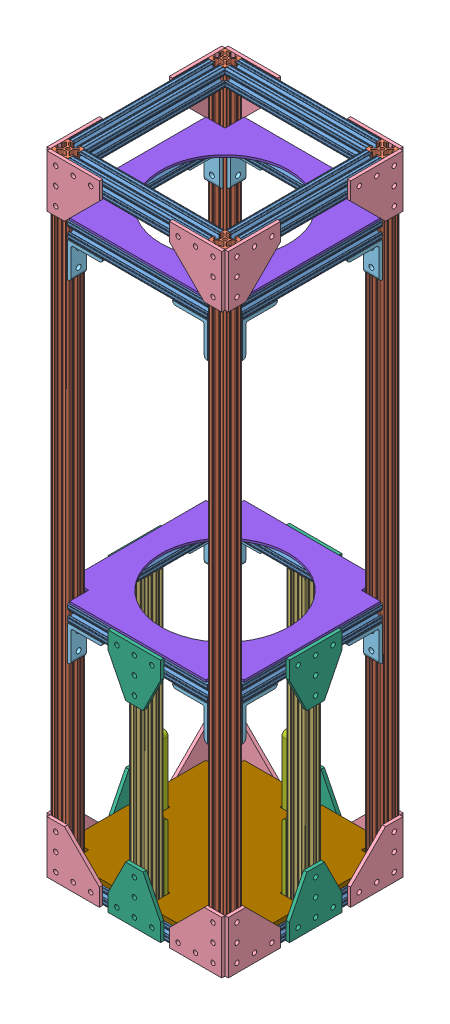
SolidWorks assembly Pressurant_Tank_Support.SLDASM, configuration Default (file format 15000). Lengths in mm.
Overall size (263.52 914.4 263.52).
71 component instances, 9 part files, 209 mates.
Components (placement in the parent):
- 8 in t slot-1: 8 in t slot.SLDPRT [47065T411] at (72.6323 102.8129 159.8639) size (25.4 25.4 203.2)
- 3 feet t-slot-1: 3 feet t-slot.SLDPRT [47065T412] at (72.6323 547.3129 274.1639) x (1 0 0) z (0 -1 0) size (25.4 25.4 914.4)
- 3 feet t-slot-2: 3 feet t-slot.SLDPRT [47065T412] at (301.2323 547.3129 274.1639) x (1 0 0) z (0 -1 0) size (25.4 25.4 914.4)
- 3 feet t-slot-3: 3 feet t-slot.SLDPRT [47065T412] at (301.2323 547.3129 45.5639) x (1 0 0) z (0 -1 0) size (25.4 25.4 914.4)
- 3 feet t-slot-4: 3 feet t-slot.SLDPRT [47065T412] at (72.6323 547.3129 45.5639) x (1 0 0) z (0 -1 0) size (25.4 25.4 914.4)
- 8 in t slot-2: 8 in t slot.SLDPRT [47065T411] at (186.9323 102.8129 274.1639) x (0 0 1) z (-1 0 0) size (25.4 25.4 203.2)
- 8 in t slot-3: 8 in t slot.SLDPRT [47065T411] at (301.2323 102.8129 159.8639) size (25.4 25.4 203.2)
- 8 in t slot-4: 8 in t slot.SLDPRT [47065T411] at (186.9323 102.8129 45.5639) x (0 0 -1) z (1 0 0) size (25.4 25.4 203.2)
- 1 foot t slot-1: 1 foot t slot.SLDPRT [47065T411] at (72.6323 267.9129 159.8639) x (0 0 1) z (0 1 0) size (25.4 25.4 304.8)
- 1 foot t slot-2: 1 foot t slot.SLDPRT [47065T411] at (186.9323 267.9129 45.5639) x (0 0 1) z (0 1 0) size (25.4 25.4 304.8)
- 1 foot t slot-3: 1 foot t slot.SLDPRT [47065T411] at (301.2323 267.9129 159.8639) x (0 0 1) z (0 1 0) size (25.4 25.4 304.8)
- 1 foot t slot-4: 1 foot t slot.SLDPRT [47065T411] at (186.9323 267.9129 274.1639) x (0 0 1) z (0 1 0) size (25.4 25.4 304.8)
- 8 in t slot-5: 8 in t slot.SLDPRT [47065T411] at (186.9323 433.0129 45.5639) x (0 0 1) z (-1 0 0) size (25.4 25.4 203.2)
- 8 in t slot-6: 8 in t slot.SLDPRT [47065T411] at (301.2323 433.0129 159.8639) size (25.4 25.4 203.2)
- 8 in t slot-7: 8 in t slot.SLDPRT [47065T411] at (186.9323 433.0129 274.1639) x (0 0 1) z (-1 0 0) size (25.4 25.4 203.2)
- 8 in t slot-8: 8 in t slot.SLDPRT [47065T411] at (72.6323 433.0129 159.8639) size (25.4 25.4 203.2)
- 8 in t slot-9: 8 in t slot.SLDPRT [47065T411] at (301.2323 991.8129 159.8639) size (25.4 25.4 203.2)
- 8 in t slot-10: 8 in t slot.SLDPRT [47065T411] at (186.9323 991.8129 274.1639) x (0 0 1) z (-1 0 0) size (25.4 25.4 203.2)
- 8 in t slot-11: 8 in t slot.SLDPRT [47065T411] at (186.9323 991.8129 45.5639) x (0 -1 0) z (1 0 0) size (25.4 25.4 203.2)
- 8 in t slot-12: 8 in t slot.SLDPRT [47065T411] at (72.6323 991.8129 159.8639) size (25.4 25.4 203.2)
- corner brace-1: corner brace.SLDPRT [47065T267] at (57.551 1004.5129 286.8639) x (0 0 -1) z (-1 0 0) size (76.2 76.2 4.76)
- corner brace-2: corner brace.SLDPRT [47065T267] at (59.9323 90.1129 289.2452) size (76.2 76.2 4.76)
- corner brace-3: corner brace.SLDPRT [47065T267] at (313.9323 90.1129 289.2452) x (-1 0 0) z (0 0 -1) size (76.2 76.2 4.76)
- corner brace-4: corner brace.SLDPRT [47065T267] at (316.3135 90.1129 286.8639) x (0 0 -1) z (1 0 0) size (76.2 76.2 4.76)
- corner brace-5: corner brace.SLDPRT [47065T267] at (316.3135 90.1129 32.8639) x (0 0 1) z (-1 0 0) size (76.2 76.2 4.76)
- corner brace-6: corner brace.SLDPRT [47065T267] at (59.9323 90.1129 30.4827) size (76.2 76.2 4.76)
- corner brace-7: corner brace.SLDPRT [47065T267] at (313.9323 90.1129 30.4827) x (-1 0 0) z (0 0 -1) size (76.2 76.2 4.76)
- corner brace-8: corner brace.SLDPRT [47065T267] at (57.551 90.1129 32.8639) x (0 0 1) z (-1 0 0) size (76.2 76.2 4.76)
- corner brace-10: corner brace.SLDPRT [47065T267] at (316.3135 1004.5129 32.8639) x (0 -1 0) z (-1 0 0) size (76.2 76.2 4.76)
- corner brace-11: corner brace.SLDPRT [47065T267] at (313.9323 1004.5129 30.4827) x (-1 0 0) z (0 0 1) size (76.2 76.2 4.76)
- corner brace-12: corner brace.SLDPRT [47065T267] at (316.3135 1004.5129 286.8639) x (0 -1 0) z (1 0 0) size (76.2 76.2 4.76)
- corner brace-13: corner brace.SLDPRT [47065T267] at (313.9323 1004.5129 289.2452) x (-1 0 0) z (0 0 1) size (76.2 76.2 4.76)
- corner brace-14: corner brace.SLDPRT [47065T267] at (59.9323 1004.5129 289.2452) x (1 0 0) z (0 0 -1) size (76.2 76.2 4.76)
- corner brace-15: corner brace.SLDPRT [47065T267] at (57.551 90.1129 286.8639) x (0 0 -1) z (1 0 0) size (76.2 76.2 4.76)
- corner brace_2-1: corner brace_2.SLDPRT [47065T239] at (71.0448 420.3129 261.4639) x (0 -1 0) z (1 0 0) size (50.8 50.8 22.23)
- corner brace_2-2: corner brace_2.SLDPRT [47065T239] at (71.0448 420.3129 58.2639) x (0 -1 0) z (-1 0 0) size (50.8 50.8 22.23)
- corner brace_2-3: corner brace_2.SLDPRT [47065T239] at (85.3323 420.3129 43.9764) x (0 -1 0) z (0 0 1) size (50.8 50.8 22.23)
- corner brace_2-4: corner brace_2.SLDPRT [47065T239] at (288.5323 420.3129 43.9764) x (0 -1 0) z (0 0 -1) size (50.8 50.8 22.23)
- corner brace_2-5: corner brace_2.SLDPRT [47065T239] at (85.3323 420.3129 275.7514) x (0 -1 0) z (0 0 1) size (50.8 50.8 22.23)
- corner brace_2-6: corner brace_2.SLDPRT [47065T239] at (288.5323 420.3129 275.7514) x (0 -1 0) z (0 0 -1) size (50.8 50.8 22.23)
- corner brace_2-7: corner brace_2.SLDPRT [47065T239] at (302.8198 420.3129 261.4639) x (0 -1 0) z (1 0 0) size (50.8 50.8 22.23)
- corner brace_2-8: corner brace_2.SLDPRT [47065T239] at (302.8198 420.3129 58.2639) x (0 -1 0) z (-1 0 0) size (50.8 50.8 22.23)
- t bracket-1: t bracket.SLDPRT [47065T278] at (148.8323 90.1129 30.4827) size (76.2 76.2 4.76)
- t bracket-2: t bracket.SLDPRT [47065T278] at (57.551 90.1129 121.7639) x (0 0 1) z (-1 0 0) size (76.2 76.2 4.76)
- t bracket-3: t bracket.SLDPRT [47065T278] at (148.8323 90.1129 289.2452) size (76.2 76.2 4.76)
- t bracket-4: t bracket.SLDPRT [47065T278] at (316.3135 90.1129 197.9639) x (0 0 -1) z (1 0 0) size (76.2 76.2 4.76)
- 47065T841_ALUMINUM T-SLOTTED FRAMING EXTRUSION-1: 47065T841_ALUMINUM T-SLOTTED FRAMING EXTRUSION.SLDPRT [47065T841] at (85.3323 90.1129 159.8639) size (50.8 127 25.4)
- 47065T841_ALUMINUM T-SLOTTED FRAMING EXTRUSION-2: 47065T841_ALUMINUM T-SLOTTED FRAMING EXTRUSION.SLDPRT [47065T841] at (186.9323 90.1129 58.2639) x (0 0 1) z (-1 0 0) size (50.8 127 25.4)
- 47065T841_ALUMINUM T-SLOTTED FRAMING EXTRUSION-3: 47065T841_ALUMINUM T-SLOTTED FRAMING EXTRUSION.SLDPRT [47065T841] at (288.5323 90.1129 159.8639) x (-1 0 0) z (0 0 -1) size (50.8 127 25.4)
- 47065T841_ALUMINUM T-SLOTTED FRAMING EXTRUSION-4: 47065T841_ALUMINUM T-SLOTTED FRAMING EXTRUSION.SLDPRT [47065T841] at (186.9323 90.1129 261.4639) x (0 0 -1) z (1 0 0) size (50.8 127 25.4)
- Pressurant Tank mid-holder-1: Pressurant Tank mid-holder.SLDPRT [Default] at (186.9323 445.7129 159.8639) size (254 3.17 254)
- 8 in t slot-13: 8 in t slot.SLDPRT [47065T411] at (186.9323 915.6129 274.1639) x (0 0 -1) z (1 0 0) size (25.4 25.4 203.2)
- 8 in t slot-14: 8 in t slot.SLDPRT [47065T411] at (186.9323 915.6129 45.5639) x (0 0 -1) z (1 0 0) size (25.4 25.4 203.2)
- 8 in t slot-15: 8 in t slot.SLDPRT [47065T411] at (301.2323 915.6129 159.8639) size (25.4 25.4 203.2)
- 8 in t slot-16: 8 in t slot.SLDPRT [47065T411] at (72.6323 915.6129 159.8639) size (25.4 25.4 203.2)
- Pressurant Tank mid-holder-2: Pressurant Tank mid-holder.SLDPRT [Default] at (186.9323 928.3129 159.8639) size (254 3.17 254)
- corner brace-16: corner brace.SLDPRT [47065T267] at (57.551 1004.5129 32.8639) x (0 -1 0) z (-1 0 0) size (76.2 76.2 4.76)
- corner brace-17: corner brace.SLDPRT [47065T267] at (59.9323 1004.5129 30.4827) x (1 0 0) z (0 0 -1) size (76.2 76.2 4.76)
- Pressurant Tank bottom-holder plate-1: Pressurant Tank bottom-holder plate.SLDPRT [Default] at (186.9323 115.5129 159.8639) size (254 6.35 254)
- t bracket-5: t bracket.SLDPRT [47065T278] at (148.8323 445.7129 289.2452) x (1 0 0) z (0 0 -1) size (76.2 76.2 4.76)
- t bracket-6: t bracket.SLDPRT [47065T278] at (225.0323 448.2991 30.4827) x (-1 0 0) z (0 0 1) size (76.2 76.2 4.76)
- t bracket-7: t bracket.SLDPRT [47065T278] at (316.3135 445.7129 121.7639) x (0 0 1) z (1 0 0) size (76.2 76.2 4.76)
- t bracket-8: t bracket.SLDPRT [47065T278] at (57.551 445.7129 197.9639) x (0 0 -1) z (-1 0 0) size (76.2 76.2 4.76)
- corner brace_2-9: corner brace_2.SLDPRT [47065T239] at (288.5323 902.9129 275.7514) x (0 -1 0) z (0 0 -1) size (50.8 50.8 22.23)
- corner brace_2-10: corner brace_2.SLDPRT [47065T239] at (85.3323 902.9129 275.7514) x (0 -1 0) z (0 0 1) size (50.8 50.8 22.23)
- corner brace_2-11: corner brace_2.SLDPRT [47065T239] at (302.8198 902.9129 261.4639) x (0 -1 0) z (1 0 0) size (50.8 50.8 22.23)
- corner brace_2-12: corner brace_2.SLDPRT [47065T239] at (71.0448 902.9129 261.4639) x (0 -1 0) z (1 0 0) size (50.8 50.8 22.23)
- corner brace_2-13: corner brace_2.SLDPRT [47065T239] at (71.0448 902.9129 58.2639) x (0 -1 0) z (-1 0 0) size (50.8 50.8 22.23)
- corner brace_2-14: corner brace_2.SLDPRT [47065T239] at (302.8198 902.9129 58.2639) x (0 -1 0) z (-1 0 0) size (50.8 50.8 22.23)
- corner brace_2-15: corner brace_2.SLDPRT [47065T239] at (85.3323 902.9129 43.9764) x (0 -1 0) z (0 0 1) size (50.8 50.8 22.23)
- corner brace_2-16: corner brace_2.SLDPRT [47065T239] at (288.5323 902.9129 43.9764) x (0 -1 0) z (0 0 -1) size (50.8 50.8 22.23)
Mates (geometry in assembly coordinates):
- Coincident1: coincident anti-aligned: plane of 8 in t slot-1 through (66.2159 93.403 261.4639) normal (0 0 1); plane of 3 feet t-slot-1 through (78.9654 90.1129 261.4639) normal (0 0 -1)
- Coincident2: coincident aligned: plane of 8 in t slot-1 through (85.3323 93.2625 261.4639) normal (1 0 0); plane of 3 feet t-slot-1 through (85.3323 90.1129 264.6135) normal (1 0 0)
- Coincident3: coincident aligned: plane of 8 in t slot-1 through (78.9654 90.1129 261.4639) normal (0 -1 0); plane of 3 feet t-slot-1 through (66.2159 90.1129 264.7541) normal (0 -1 0)
- Coincident4: coincident aligned: plane of 3 feet t-slot-1 through (82.1827 90.1129 286.8639) normal (0 0 1); plane of 8 in t slot-2 through (85.3323 109.1459 286.8639) normal (0 0 1)
- Coincident5: coincident anti-aligned: plane of 3 feet t-slot-1 through (85.3323 90.1129 280.497) normal (1 0 0); plane of 8 in t slot-2 through (85.3323 93.403 267.7475) normal (-1 0 0)
- Coincident6: coincident aligned: plane of 3 feet t-slot-1 through (66.2159 90.1129 264.7541) normal (0 -1 0); plane of 8 in t slot-2 through (85.3323 90.1129 280.4971) normal (0 -1 0)
- Coincident7: coincident aligned: plane of 3 feet t-slot-2 through (294.8159 90.1129 264.7541) normal (0 -1 0); plane of 8 in t slot-2 through (85.3323 90.1129 280.4971) normal (0 -1 0)
- Coincident8: coincident aligned: plane of 3 feet t-slot-2 through (310.7827 90.1129 286.8639) normal (0 0 1); plane of 8 in t slot-2 through (85.3323 93.2625 286.8639) normal (0 0 1)
- Coincident9: coincident anti-aligned: plane of 3 feet t-slot-2 through (288.5323 90.1129 283.7143) normal (-1 0 0); plane of 8 in t slot-2 through (288.5323 93.403 267.7475) normal (1 0 0)
- Coincident10: coincident aligned: plane of 8 in t slot-1 through (78.9654 90.1129 261.4639) normal (0 -1 0); plane of 3 feet t-slot-4 through (66.2159 90.1129 36.1541) normal (0 -1 0)
- Coincident11: coincident aligned: plane of 8 in t slot-1 through (85.3323 109.1459 261.4639) normal (1 0 0); plane of 3 feet t-slot-4 through (85.3323 90.1129 51.897) normal (1 0 0)
- Coincident12: coincident anti-aligned: plane of 8 in t slot-1 through (66.2159 93.403 58.2639) normal (0 0 -1); plane of 3 feet t-slot-4 through (82.1827 90.1129 58.2639) normal (0 0 1)
- Coincident13: coincident anti-aligned: plane of 3 feet t-slot-4 through (85.3323 90.1129 36.0135) normal (1 0 0); plane of 8 in t slot-4 through (85.3323 93.403 51.9803) normal (-1 0 0)
- Coincident14: coincident aligned: plane of 3 feet t-slot-4 through (78.9654 90.1129 32.8639) normal (0 0 -1); plane of 8 in t slot-4 through (288.5323 93.2625 32.8639) normal (0 0 -1)
- Coincident15: coincident aligned: plane of 3 feet t-slot-4 through (66.2159 90.1129 36.1541) normal (0 -1 0); plane of 8 in t slot-4 through (288.5323 90.1129 39.2308) normal (0 -1 0)
- Coincident16: coincident aligned: plane of 3 feet t-slot-3 through (294.8159 90.1129 36.1541) normal (0 -1 0); plane of 8 in t slot-4 through (288.5323 90.1129 39.2308) normal (0 -1 0)
- Coincident17: coincident aligned: plane of 3 feet t-slot-3 through (291.6819 90.1129 32.8639) normal (0 0 -1); plane of 8 in t slot-4 through (288.5323 109.1459 32.8639) normal (0 0 -1)
- Coincident18: coincident anti-aligned: plane of 3 feet t-slot-3 through (288.5323 90.1129 39.2308) normal (-1 0 0); plane of 8 in t slot-4 through (288.5323 93.403 51.9803) normal (1 0 0)
- Coincident19: coincident aligned: plane of 3 feet t-slot-2 through (288.5323 90.1129 267.8308) normal (-1 0 0); plane of 8 in t slot-3 through (288.5323 112.3633 261.4639) normal (-1 0 0)
- Coincident20: coincident aligned: plane of 3 feet t-slot-2 through (294.8159 90.1129 264.7541) normal (0 -1 0); plane of 8 in t slot-3 through (291.6819 90.1129 261.4639) normal (0 -1 0)
- Coincident21: coincident anti-aligned: plane of 3 feet t-slot-2 through (307.5654 90.1129 261.4639) normal (0 0 -1); plane of 8 in t slot-3 through (294.8159 93.403 261.4639) normal (0 0 1)
- Coincident22: coincident anti-aligned: plane of 8 in t slot-1 through (82.1827 115.5129 261.4639) normal (0 1 0); plane of 1 foot t slot-1 through (63.2225 115.5129 153.4475) normal (0 -1 0)
- Coincident23: coincident aligned: plane of 8 in t slot-1 through (85.3323 109.1459 261.4639) normal (1 0 0); plane of 1 foot t slot-1 through (85.3323 420.3129 153.5308) normal (1 0 0)
- Distance1: distance = 88.9 mm anti-aligned: plane of 3 feet t-slot-4 through (66.2992 90.1129 58.2639) normal (0 0 1); plane of 1 foot t slot-1 through (66.2992 420.3129 147.1639) normal (0 0 -1)
- Coincident25: coincident anti-aligned: plane of 8 in t slot-2 through (85.3323 115.5129 283.7144) normal (0 1 0); plane of 1 foot t slot-4 through (177.5225 115.5129 267.7475) normal (0 -1 0)
- Coincident26: coincident aligned: plane of 8 in t slot-2 through (85.3323 109.1459 286.8639) normal (0 0 1); plane of 1 foot t slot-4 through (177.3819 420.3129 286.8639) normal (0 0 1)
- Distance2: distance = 88.9 mm anti-aligned: plane of 1 foot t slot-4 through (174.2323 420.3129 280.4971) normal (-1 0 0); plane of 3 feet t-slot-1 through (85.3323 90.1129 280.497) normal (1 0 0)
- Coincident28: coincident anti-aligned: plane of 8 in t slot-3 through (310.7827 115.5129 261.4639) normal (0 1 0); plane of 1 foot t slot-3 through (291.8225 115.5129 153.4475) normal (0 -1 0)
- Coincident29: coincident aligned: plane of 8 in t slot-3 through (313.9323 109.1459 261.4639) normal (1 0 0); plane of 1 foot t slot-3 through (313.9323 420.3129 153.5308) normal (1 0 0)
- Distance3: distance = 88.9 mm anti-aligned: plane of 3 feet t-slot-2 through (307.5654 90.1129 261.4639) normal (0 0 -1); plane of 1 foot t slot-3 through (307.5654 420.3129 172.5639) normal (0 0 1)
- Coincident31: coincident anti-aligned: plane of 8 in t slot-4 through (288.5323 115.5129 36.0135) normal (0 1 0); plane of 1 foot t slot-2 through (177.5225 115.5129 39.1475) normal (0 -1 0)
- Coincident32: coincident aligned: plane of 8 in t slot-4 through (288.5323 109.1459 32.8639) normal (0 0 -1); plane of 1 foot t slot-2 through (196.4827 420.3129 32.8639) normal (0 0 -1)
- Distance4: distance = 88.9 mm anti-aligned: plane of 1 foot t slot-2 through (199.6323 420.3129 39.2308) normal (1 0 0); plane of 3 feet t-slot-3 through (288.5323 90.1129 39.2308) normal (-1 0 0)
- Coincident34: coincident aligned: plane of 1 foot t slot-2 through (196.4827 420.3129 32.8639) normal (0 0 -1); plane of 8 in t slot-5 through (85.3323 426.6798 32.8639) normal (0 0 -1)
- Coincident35: coincident anti-aligned: plane of 1 foot t slot-2 through (177.5225 420.3129 39.1475) normal (0 1 0); plane of 8 in t slot-5 through (85.3323 420.3129 36.0135) normal (0 -1 0)
- Coincident36: coincident anti-aligned: plane of 3 feet t-slot-3 through (288.5323 90.1129 39.2308) normal (-1 0 0); plane of 8 in t slot-5 through (288.5323 423.603 39.1475) normal (1 0 0)
- Coincident37: coincident anti-aligned: plane of 1 foot t slot-1 through (63.2225 420.3129 153.4475) normal (0 1 0); plane of 8 in t slot-8 through (63.0819 420.3129 261.4639) normal (0 -1 0)
- Coincident38: coincident aligned: plane of 1 foot t slot-1 through (59.9323 420.3129 150.3135) normal (-1 0 0); plane of 8 in t slot-8 through (59.9323 442.5633 261.4639) normal (-1 0 0)
- Coincident39: coincident anti-aligned: plane of 3 feet t-slot-1 through (63.0819 90.1129 261.4639) normal (0 0 -1); plane of 8 in t slot-8 through (66.2159 423.603 261.4639) normal (0 0 1)
- Coincident40: coincident aligned: plane of 1 foot t slot-3 through (313.9323 420.3129 169.4144) normal (1 0 0); plane of 8 in t slot-6 through (313.9323 439.3459 261.4639) normal (1 0 0)
- Coincident41: coincident anti-aligned: plane of 1 foot t slot-3 through (291.8225 420.3129 153.4475) normal (0 1 0); plane of 8 in t slot-6 through (307.5654 420.3129 261.4639) normal (0 -1 0)
- Coincident42: coincident anti-aligned: plane of 3 feet t-slot-2 through (307.5654 90.1129 261.4639) normal (0 0 -1); plane of 8 in t slot-6 through (294.8159 423.603 261.4639) normal (0 0 1)
- Coincident43: coincident anti-aligned: plane of 3 feet t-slot-2 through (288.5323 90.1129 283.7143) normal (-1 0 0); plane of 8 in t slot-7 through (288.5323 423.603 267.7475) normal (1 0 0)
- Coincident44: coincident aligned: plane of 1 foot t slot-4 through (193.2654 420.3129 286.8639) normal (0 0 1); plane of 8 in t slot-7 through (85.3323 423.4625 286.8639) normal (0 0 1)
- Coincident45: coincident anti-aligned: plane of 1 foot t slot-4 through (177.5225 420.3129 267.7475) normal (0 1 0); plane of 8 in t slot-7 through (85.3323 420.3129 280.4971) normal (0 -1 0)
- Coincident46: coincident aligned: plane of 3 feet t-slot-1 through (59.9323 90.1129 267.8308) normal (-1 0 0); plane of 8 in t slot-12 through (59.9323 1001.3633 261.4639) normal (-1 0 0)
- Coincident47: coincident anti-aligned: plane of 3 feet t-slot-4 through (66.2992 90.1129 58.2639) normal (0 0 1); plane of 8 in t slot-12 through (66.2159 982.403 58.2639) normal (0 0 -1)
- Coincident48: coincident aligned: plane of 3 feet t-slot-4 through (66.2159 1004.5129 36.1541) normal (0 1 0); plane of 8 in t slot-12 through (66.2992 1004.5129 261.4639) normal (0 1 0)
- Coincident49: coincident aligned: plane of 3 feet t-slot-1 through (82.1827 90.1129 286.8639) normal (0 0 1); plane of 8 in t slot-10 through (85.3323 998.1459 286.8639) normal (0 0 1)
- Coincident50: coincident anti-aligned: plane of 3 feet t-slot-1 through (85.3323 90.1129 280.497) normal (1 0 0); plane of 8 in t slot-10 through (85.3323 982.403 267.7475) normal (-1 0 0)
- Coincident51: coincident: point of 3 feet t-slot-1; plane of 8 in t slot-10 through (85.3323 1004.5129 283.7144) normal (0 1 0)
- Coincident52: coincident aligned: plane of 3 feet t-slot-2 through (294.8159 1004.5129 264.7541) normal (0 1 0); plane of 8 in t slot-9 through (294.8992 1004.5129 261.4639) normal (0 1 0)
- Coincident53: coincident anti-aligned: plane of 3 feet t-slot-2 through (291.6819 90.1129 261.4639) normal (0 0 -1); plane of 8 in t slot-9 through (294.8159 982.403 261.4639) normal (0 0 1)
- Coincident54: coincident aligned: plane of 3 feet t-slot-2 through (313.9323 90.1129 264.6135) normal (1 0 0); plane of 8 in t slot-9 through (313.9323 998.1459 261.4639) normal (1 0 0)
- Coincident55: coincident aligned: plane of 3 feet t-slot-4 through (66.2159 1004.5129 36.1541) normal (0 1 0); plane of 8 in t slot-11 through (288.5323 1004.5129 51.897) normal (0 1 0)
- Coincident56: coincident anti-aligned: plane of 3 feet t-slot-3 through (288.5323 90.1129 39.2308) normal (-1 0 0); plane of 8 in t slot-11 through (288.5323 998.2293 54.9738) normal (1 0 0)
- Coincident57: coincident aligned: plane of 3 feet t-slot-3 through (291.6819 90.1129 32.8639) normal (0 0 -1); plane of 8 in t slot-11 through (288.5323 998.146 32.8639) normal (0 0 -1)
- Coincident58: coincident aligned: plane of 3 feet t-slot-3 through (307.5654 90.1129 32.8639) normal (0 0 -1); plane of corner brace-5 through (313.9323 90.1129 32.8639) normal (0 0 -1)
- Coincident59: coincident aligned: plane of 3 feet t-slot-3 through (294.8159 90.1129 36.1541) normal (0 -1 0); plane of corner brace-5 through (313.9323 90.1129 109.0639) normal (0 -1 0)
- Coincident60: coincident anti-aligned: plane of 3 feet t-slot-3 through (313.9323 90.1129 36.0135) normal (1 0 0); plane of corner brace-5 through (313.9323 90.1129 32.8639) normal (-1 0 0)
- Coincident61: coincident aligned: plane of 3 feet t-slot-3 through (313.9323 90.1129 36.0135) normal (1 0 0); plane of corner brace-7 through (313.9323 90.1129 28.1014) normal (1 0 0)
- Coincident62: coincident aligned: plane of 8 in t slot-4 through (288.5323 90.1129 39.2308) normal (0 -1 0); plane of corner brace-7 through (237.7323 90.1129 28.1014) normal (0 -1 0)
- Coincident63: coincident anti-aligned: plane of 3 feet t-slot-3 through (291.6819 90.1129 32.8639) normal (0 0 -1); plane of corner brace-7 through (313.9323 90.1129 32.8639) normal (0 0 1)
- Coincident64: coincident aligned: plane of 3 feet t-slot-2 through (310.7827 90.1129 286.8639) normal (0 0 1); plane of corner brace-4 through (318.6948 90.1129 286.8639) normal (0 0 1)
- Coincident65: coincident aligned: plane of 8 in t slot-3 through (307.5654 90.1129 261.4639) normal (0 -1 0); plane of corner brace-4 through (318.6948 90.1129 210.6639) normal (0 -1 0)
- Coincident66: coincident anti-aligned: plane of 8 in t slot-3 through (313.9323 93.2625 261.4639) normal (1 0 0); plane of corner brace-4 through (313.9323 90.1129 286.8639) normal (-1 0 0)
- Coincident67: coincident aligned: plane of 3 feet t-slot-2 through (313.9323 90.1129 280.497) normal (1 0 0); plane of corner brace-3 through (313.9323 90.1129 286.8639) normal (1 0 0)
- Coincident68: coincident aligned: plane of 3 feet t-slot-2 through (294.8159 90.1129 264.7541) normal (0 -1 0); plane of corner brace-3 through (237.7323 90.1129 286.8639) normal (0 -1 0)
- Coincident69: coincident: line of 3 feet t-slot-2 through (310.7827 90.1129 286.8639) axis (0 1 0); plane of corner brace-3 through (313.9323 90.1129 286.8639) normal (0 0 -1)
- Coincident70: coincident aligned: plane of 3 feet t-slot-1 through (59.9323 90.1129 283.7143) normal (-1 0 0); plane of corner brace-2 through (59.9323 90.1129 291.6264) normal (-1 0 0)
- Coincident71: coincident aligned: plane of 3 feet t-slot-1 through (66.2159 90.1129 264.7541) normal (0 -1 0); plane of corner brace-2 through (136.1323 90.1129 291.6264) normal (0 -1 0)
- Coincident72: coincident anti-aligned: plane of 3 feet t-slot-1 through (66.2992 90.1129 286.8639) normal (0 0 1); plane of corner brace-2 through (59.9323 90.1129 286.8639) normal (0 0 -1)
- Coincident73: coincident aligned: plane of 3 feet t-slot-4 through (63.0819 90.1129 32.8639) normal (0 0 -1); plane of corner brace-8 through (55.1698 90.1129 32.8639) normal (0 0 -1)
- Coincident74: coincident aligned: plane of 3 feet t-slot-4 through (66.2159 90.1129 36.1541) normal (0 -1 0); plane of corner brace-8 through (55.1698 90.1129 109.0639) normal (0 -1 0)
- Coincident75: coincident anti-aligned: plane of 3 feet t-slot-4 through (59.9323 90.1129 39.2308) normal (-1 0 0); plane of corner brace-8 through (59.9323 90.1129 32.8639) normal (1 0 0)
- Coincident76: coincident aligned: plane of 3 feet t-slot-4 through (59.9323 90.1129 39.2308) normal (-1 0 0); plane of corner brace-6 through (59.9323 90.1129 32.8639) normal (-1 0 0)
- Coincident77: coincident aligned: plane of 8 in t slot-4 through (288.5323 90.1129 39.2308) normal (0 -1 0); plane of corner brace-6 through (136.1323 90.1129 32.8639) normal (0 -1 0)
- Coincident78: coincident anti-aligned: plane of 3 feet t-slot-4 through (63.0819 90.1129 32.8639) normal (0 0 -1); plane of corner brace-6 through (59.9323 90.1129 32.8639) normal (0 0 1)
- Coincident79: coincident aligned: plane of 3 feet t-slot-3 through (313.9323 90.1129 36.0135) normal (1 0 0); plane of corner brace-11 through (313.9323 1004.5129 32.8639) normal (1 0 0)
- Coincident80: coincident aligned: plane of 8 in t slot-11 through (288.5323 1004.5129 36.0135) normal (0 1 0); plane of corner brace-11 through (237.7323 1004.5129 32.8639) normal (0 1 0)
- Coincident81: coincident anti-aligned: plane of 8 in t slot-11 through (288.5323 998.146 32.8639) normal (0 0 -1); plane of corner brace-11 through (313.9323 1004.5129 32.8639) normal (0 0 1)
- Coincident82: coincident aligned: plane of 3 feet t-slot-3 through (307.5654 90.1129 32.8639) normal (0 0 -1); plane of corner brace-10 through (313.9323 928.3129 32.8639) normal (0 0 -1)
- Coincident83: coincident aligned: plane of 3 feet t-slot-3 through (294.8159 1004.5129 36.1541) normal (0 1 0); plane of corner brace-10 through (313.9323 1004.5129 32.8639) normal (0 1 0)
- Coincident84: coincident anti-aligned: plane of 3 feet t-slot-3 through (313.9323 90.1129 36.0135) normal (1 0 0); plane of corner brace-10 through (313.9323 1004.5129 32.8639) normal (-1 0 0)
- Coincident85: coincident aligned: plane of 3 feet t-slot-1 through (66.2159 1004.5129 264.7541) normal (0 1 0); plane of corner brace-1 through (55.1698 1004.5129 210.6639) normal (0 1 0)
- Coincident86: coincident aligned: plane of 3 feet t-slot-1 through (66.2992 90.1129 286.8639) normal (0 0 1); plane of corner brace-1 through (55.1698 1004.5129 286.8639) normal (0 0 1)
- Coincident87: coincident anti-aligned: plane of 8 in t slot-12 through (59.9323 1001.3633 261.4639) normal (-1 0 0); plane of corner brace-1 through (59.9323 1004.5129 286.8639) normal (1 0 0)
- Coincident88: coincident aligned: plane of 3 feet t-slot-2 through (313.9323 90.1129 280.497) normal (1 0 0); plane of corner brace-13 through (313.9323 1004.5129 291.6264) normal (1 0 0)
- Coincident89: coincident aligned: plane of 3 feet t-slot-2 through (294.8159 1004.5129 264.7541) normal (0 1 0); plane of corner brace-13 through (237.7323 1004.5129 291.6264) normal (0 1 0)
- Coincident91: coincident anti-aligned: plane of 3 feet t-slot-2 through (310.7827 90.1129 286.8639) normal (0 0 1); plane of corner brace-13 through (313.9323 1004.5129 286.8639) normal (0 0 -1)
- Coincident92: coincident aligned: plane of 3 feet t-slot-2 through (310.7827 90.1129 286.8639) normal (0 0 1); plane of corner brace-12 through (318.6948 928.3129 286.8639) normal (0 0 1)
- Coincident93: coincident aligned: plane of 8 in t slot-9 through (310.7827 1004.5129 261.4639) normal (0 1 0); plane of corner brace-12 through (318.6948 1004.5129 286.8639) normal (0 1 0)
- Coincident94: coincident anti-aligned: plane of 8 in t slot-9 through (313.9323 998.1459 261.4639) normal (1 0 0); plane of corner brace-12 through (313.9323 1004.5129 286.8639) normal (-1 0 0)
- Coincident95: coincident aligned: plane of 3 feet t-slot-1 through (59.9323 90.1129 283.7143) normal (-1 0 0); plane of corner brace-14 through (59.9323 1004.5129 286.8639) normal (-1 0 0)
- Coincident96: coincident aligned: plane of 8 in t slot-10 through (85.3323 1004.5129 283.7144) normal (0 1 0); plane of corner brace-14 through (136.1323 1004.5129 286.8639) normal (0 1 0)
- Coincident97: coincident anti-aligned: plane of 3 feet t-slot-1 through (82.1827 90.1129 286.8639) normal (0 0 1); plane of corner brace-14 through (59.9323 1004.5129 286.8639) normal (0 0 -1)
- Coincident98: coincident aligned: plane of 3 feet t-slot-1 through (66.2992 90.1129 286.8639) normal (0 0 1); plane of corner brace-15 through (59.9323 90.1129 286.8639) normal (0 0 1)
- Coincident99: coincident aligned: plane of 3 feet t-slot-1 through (66.2159 90.1129 264.7541) normal (0 -1 0); plane of corner brace-15 through (59.9323 90.1129 210.6639) normal (0 -1 0)
- Coincident100: coincident anti-aligned: plane of 3 feet t-slot-1 through (59.9323 90.1129 283.7143) normal (-1 0 0); plane of corner brace-15 through (59.9323 90.1129 286.8639) normal (1 0 0)
- Coincident101: coincident anti-aligned: plane of 8 in t slot-8 through (63.0819 420.3129 261.4639) normal (0 -1 0); plane of corner brace_2-1 through (82.1573 420.3129 261.4639) normal (0 1 0)
- Coincident102: coincident anti-aligned: plane of 3 feet t-slot-1 through (63.0819 90.1129 261.4639) normal (0 0 -1); plane of corner brace_2-1 through (82.1573 369.5129 261.4639) normal (0 0 1)
- Coincident103: coincident aligned: plane of 8 in t slot-8 through (59.9323 426.6798 261.4639) normal (-1 0 0); plane of corner brace_2-1 through (59.9323 420.3129 215.4391) normal (-1 0 0)
- Coincident104: coincident anti-aligned: plane of 8 in t slot-8 through (63.0819 420.3129 261.4639) normal (0 -1 0); plane of corner brace_2-2 through (59.9323 420.3129 58.2639) normal (0 1 0)
- Coincident105: coincident anti-aligned: plane of 3 feet t-slot-4 through (66.2992 90.1129 58.2639) normal (0 0 1); plane of corner brace_2-2 through (59.9323 369.5129 58.2639) normal (0 0 -1)
- Coincident106: coincident aligned: plane of 8 in t slot-8 through (59.9323 426.6798 261.4639) normal (-1 0 0); plane of corner brace_2-2 through (59.9323 420.3129 104.2887) normal (-1 0 0)
- Coincident107: coincident anti-aligned: plane of 8 in t slot-5 through (85.3323 420.3129 36.0135) normal (0 -1 0); plane of corner brace_2-3 through (85.3323 420.3129 55.0889) normal (0 1 0)
- Coincident108: coincident anti-aligned: plane of 3 feet t-slot-4 through (85.3323 90.1129 36.0135) normal (1 0 0); plane of corner brace_2-3 through (85.3323 369.5129 55.0889) normal (-1 0 0)
- Coincident109: coincident aligned: plane of 8 in t slot-5 through (85.3323 426.6798 32.8639) normal (0 0 -1); plane of corner brace_2-3 through (131.3571 420.3129 32.8639) normal (0 0 -1)
- Coincident110: coincident aligned: plane of 8 in t slot-5 through (85.3323 426.6798 32.8639) normal (0 0 -1); plane of corner brace_2-4 through (242.5075 420.3129 32.8639) normal (0 0 -1)
- Coincident111: coincident anti-aligned: plane of 3 feet t-slot-3 through (288.5323 90.1129 39.2308) normal (-1 0 0); plane of corner brace_2-4 through (288.5323 369.5129 32.8639) normal (1 0 0)
- Coincident112: coincident anti-aligned: plane of 8 in t slot-5 through (85.3323 420.3129 36.0135) normal (0 -1 0); plane of corner brace_2-4 through (288.5323 420.3129 32.8639) normal (0 1 0)
- Coincident113: coincident anti-aligned: plane of 8 in t slot-6 through (307.5654 420.3129 261.4639) normal (0 -1 0); plane of corner brace_2-8 through (291.7073 420.3129 58.2639) normal (0 1 0)
- Coincident114: coincident anti-aligned: plane of 3 feet t-slot-3 through (310.7827 90.1129 58.2639) normal (0 0 1); plane of corner brace_2-8 through (291.7073 369.5129 58.2639) normal (0 0 -1)
- Coincident115: coincident aligned: plane of 8 in t slot-6 through (313.9323 423.4625 261.4639) normal (1 0 0); plane of corner brace_2-8 through (313.9323 420.3129 104.2887) normal (1 0 0)
- Coincident116: coincident anti-aligned: plane of 8 in t slot-6 through (307.5654 420.3129 261.4639) normal (0 -1 0); plane of corner brace_2-7 through (313.9323 420.3129 261.4639) normal (0 1 0)
- Coincident117: coincident aligned: plane of 8 in t slot-6 through (313.9323 423.4625 261.4639) normal (1 0 0); plane of corner brace_2-7 through (313.9323 420.3129 215.4391) normal (1 0 0)
- Coincident118: coincident anti-aligned: plane of 3 feet t-slot-2 through (307.5654 90.1129 261.4639) normal (0 0 -1); plane of corner brace_2-7 through (313.9323 369.5129 261.4639) normal (0 0 1)
- Coincident119: coincident anti-aligned: plane of 8 in t slot-7 through (85.3323 420.3129 280.4971) normal (0 -1 0); plane of corner brace_2-6 through (288.5323 420.3129 264.6389) normal (0 1 0)
- Coincident120: coincident anti-aligned: plane of 3 feet t-slot-2 through (288.5323 90.1129 283.7143) normal (-1 0 0); plane of corner brace_2-6 through (288.5323 369.5129 264.6389) normal (1 0 0)
- Coincident121: coincident aligned: plane of 8 in t slot-7 through (85.3323 423.4625 286.8639) normal (0 0 1); plane of corner brace_2-6 through (242.5075 420.3129 286.8639) normal (0 0 1)
- Coincident122: coincident anti-aligned: plane of 8 in t slot-7 through (85.3323 420.3129 280.4971) normal (0 -1 0); plane of corner brace_2-5 through (85.3323 420.3129 286.8639) normal (0 1 0)
- Coincident123: coincident anti-aligned: plane of 3 feet t-slot-1 through (85.3323 90.1129 280.497) normal (1 0 0); plane of corner brace_2-5 through (85.3323 369.5129 286.8639) normal (-1 0 0)
- Coincident124: coincident aligned: plane of 8 in t slot-7 through (85.3323 423.4625 286.8639) normal (0 0 1); plane of corner brace_2-5 through (131.3571 420.3129 286.8639) normal (0 0 1)
- Coincident125: coincident anti-aligned: plane of 8 in t slot-3 through (313.9323 109.1459 261.4639) normal (1 0 0); plane of t bracket-4 through (313.9323 90.1129 197.9639) normal (-1 0 0)
- Coincident126: coincident aligned: plane of 8 in t slot-3 through (307.5654 90.1129 261.4639) normal (0 -1 0); plane of t bracket-4 through (318.6948 90.1129 121.7639) normal (0 -1 0)
- Coincident127: coincident: plane of 1 foot t slot-3 through (307.5654 420.3129 172.5639) normal (0 0 1); line of t bracket-4 through (318.6948 166.3129 172.5639) axis (-1 0 0)
- Coincident128: coincident anti-aligned: plane of 8 in t slot-2 through (85.3323 109.1459 286.8639) normal (0 0 1); plane of t bracket-3 through (148.8323 90.1129 286.8639) normal (0 0 -1)
- Coincident129: coincident aligned: plane of 8 in t slot-2 through (85.3323 90.1129 280.4971) normal (0 -1 0); plane of t bracket-3 through (225.0323 90.1129 291.6264) normal (0 -1 0)
- Coincident130: coincident: plane of 1 foot t slot-4 through (199.6323 420.3129 283.7144) normal (1 0 0); line of t bracket-3 through (199.6323 166.3129 291.6264) axis (0 0 -1)
- Coincident131: coincident anti-aligned: plane of 8 in t slot-1 through (59.9323 112.3633 261.4639) normal (-1 0 0); plane of t bracket-2 through (59.9323 90.1129 121.7639) normal (1 0 0)
- Coincident132: coincident aligned: plane of 8 in t slot-1 through (63.0819 90.1129 261.4639) normal (0 -1 0); plane of t bracket-2 through (55.1698 90.1129 197.9639) normal (0 -1 0)
- Coincident133: coincident: plane of 1 foot t slot-1 through (63.0819 420.3129 172.5639) normal (0 0 1); line of t bracket-2 through (55.1698 166.3129 172.5639) axis (1 0 0)
- Coincident134: coincident aligned: plane of 8 in t slot-4 through (288.5323 90.1129 39.2308) normal (0 -1 0); plane of t bracket-1 through (225.0323 90.1129 32.8639) normal (0 -1 0)
- Coincident135: coincident anti-aligned: plane of 8 in t slot-4 through (288.5323 93.2625 32.8639) normal (0 0 -1); plane of t bracket-1 through (148.8323 90.1129 32.8639) normal (0 0 1)
- Coincident136: coincident: plane of 1 foot t slot-2 through (174.2323 420.3129 36.0135) normal (-1 0 0); line of t bracket-1 through (174.2323 166.3129 32.8639) axis (0 0 -1)
- Coincident137: coincident anti-aligned: plane of 1 foot t slot-4 through (180.5992 420.3129 261.4639) normal (0 0 -1); plane of 47065T841_ALUMINUM T-SLOTTED FRAMING EXTRUSION-4 through (199.6323 90.1129 261.4639) normal (0 0 1)
- Coincident138: coincident aligned: plane of 1 foot t slot-4 through (174.2323 420.3129 264.6135) normal (-1 0 0); plane of 47065T841_ALUMINUM T-SLOTTED FRAMING EXTRUSION-4 through (174.2323 210.7629 261.4639) normal (-1 0 0)
- Coincident139: coincident aligned: plane of 8 in t slot-2 through (85.3323 90.1129 264.6135) normal (0 -1 0); plane of 47065T841_ALUMINUM T-SLOTTED FRAMING EXTRUSION-4 through (199.6323 90.1129 210.6639) normal (0 -1 0)
- Coincident140: coincident anti-aligned: plane of 1 foot t slot-1 through (85.3323 420.3129 153.5308) normal (1 0 0); plane of 47065T841_ALUMINUM T-SLOTTED FRAMING EXTRUSION-1 through (85.3323 90.1129 172.5639) normal (-1 0 0)
- Coincident141: coincident aligned: plane of 1 foot t slot-1 through (82.1827 420.3129 147.1639) normal (0 0 -1); plane of 47065T841_ALUMINUM T-SLOTTED FRAMING EXTRUSION-1 through (85.3323 210.7629 147.1639) normal (0 0 -1)
- Coincident142: coincident aligned: plane of 8 in t slot-1 through (78.9654 90.1129 261.4639) normal (0 -1 0); plane of 47065T841_ALUMINUM T-SLOTTED FRAMING EXTRUSION-1 through (136.1323 90.1129 172.5639) normal (0 -1 0)
- Coincident143: coincident anti-aligned: plane of 1 foot t slot-2 through (177.3819 420.3129 58.2639) normal (0 0 1); plane of 47065T841_ALUMINUM T-SLOTTED FRAMING EXTRUSION-2 through (174.2323 90.1129 58.2639) normal (0 0 -1)
- Coincident144: coincident aligned: plane of 1 foot t slot-2 through (174.2323 420.3129 51.8971) normal (-1 0 0); plane of 47065T841_ALUMINUM T-SLOTTED FRAMING EXTRUSION-2 through (174.2323 210.7629 58.2639) normal (-1 0 0)
- Coincident145: coincident aligned: plane of 8 in t slot-4 through (288.5323 90.1129 55.1144) normal (0 -1 0); plane of 47065T841_ALUMINUM T-SLOTTED FRAMING EXTRUSION-2 through (174.2323 90.1129 109.0639) normal (0 -1 0)
- Coincident146: coincident aligned: plane of 8 in t slot-3 through (291.6819 90.1129 261.4639) normal (0 -1 0); plane of 47065T841_ALUMINUM T-SLOTTED FRAMING EXTRUSION-3 through (237.7323 90.1129 147.1639) normal (0 -1 0)
- Coincident147: coincident anti-aligned: plane of 1 foot t slot-3 through (288.5323 420.3129 150.3135) normal (-1 0 0); plane of 47065T841_ALUMINUM T-SLOTTED FRAMING EXTRUSION-3 through (288.5323 90.1129 147.1639) normal (1 0 0)
- Coincident148: coincident aligned: plane of 1 foot t slot-3 through (294.8992 420.3129 147.1639) normal (0 0 -1); plane of 47065T841_ALUMINUM T-SLOTTED FRAMING EXTRUSION-3 through (288.5323 210.7629 147.1639) normal (0 0 -1)
- Coincident149: coincident aligned: plane of 8 in t slot-8 through (59.9323 426.6798 261.4639) normal (-1 0 0); plane of Pressurant Tank mid-holder-1 through (59.9323 448.8879 159.8639) normal (-1 0 0)
- Coincident150: coincident aligned: plane of 8 in t slot-5 through (85.3323 442.5633 32.8639) normal (0 0 -1); plane of Pressurant Tank mid-holder-1 through (186.9323 448.8879 32.8639) normal (0 0 -1)
- Coincident151: coincident anti-aligned: plane of 8 in t slot-5 through (85.3323 445.7129 39.2308) normal (0 1 0); plane of Pressurant Tank mid-holder-1 through (186.9323 445.7129 159.8639) normal (0 -1 0)
- Coincident152: coincident aligned: plane of 3 feet t-slot-1 through (59.9323 90.1129 267.8308) normal (-1 0 0); plane of 8 in t slot-16 through (59.9323 925.1633 261.4639) normal (-1 0 0)
- Coincident153: coincident anti-aligned: plane of 3 feet t-slot-4 through (66.2992 90.1129 58.2639) normal (0 0 1); plane of 8 in t slot-16 through (66.2159 906.203 58.2639) normal (0 0 -1)
- Coincident155: coincident anti-aligned: plane of corner brace-1 through (55.1698 928.3129 286.8639) normal (0 -1 0); plane of 8 in t slot-16 through (66.2992 928.3129 261.4639) normal (0 1 0)
- Coincident156: coincident aligned: plane of 3 feet t-slot-1 through (82.1827 90.1129 286.8639) normal (0 0 1); plane of 8 in t slot-13 through (288.5323 925.1633 286.8639) normal (0 0 1)
- Coincident157: coincident anti-aligned: plane of 3 feet t-slot-1 through (85.3323 90.1129 280.497) normal (1 0 0); plane of 8 in t slot-13 through (85.3323 906.203 280.5803) normal (-1 0 0)
- Coincident158: coincident anti-aligned: plane of corner brace-14 through (59.9323 928.3129 286.8639) normal (0 -1 0); plane of 8 in t slot-13 through (288.5323 928.3129 280.4971) normal (0 1 0)
- Coincident159: coincident aligned: plane of 3 feet t-slot-2 through (313.9323 90.1129 264.6135) normal (1 0 0); plane of 8 in t slot-15 through (313.9323 921.9459 261.4639) normal (1 0 0)
- Coincident160: coincident anti-aligned: plane of 3 feet t-slot-2 through (307.5654 90.1129 261.4639) normal (0 0 -1); plane of 8 in t slot-15 through (294.8159 906.203 261.4639) normal (0 0 1)
- Coincident161: coincident anti-aligned: plane of corner brace-12 through (318.6948 928.3129 261.4639) normal (0 -1 0); plane of 8 in t slot-15 through (310.7827 928.3129 261.4639) normal (0 1 0)
- Coincident162: coincident anti-aligned: plane of corner brace-11 through (313.9323 928.3129 32.8639) normal (0 -1 0); plane of 8 in t slot-14 through (288.5323 928.3129 36.0135) normal (0 1 0)
- Coincident163: coincident aligned: plane of 3 feet t-slot-3 through (291.6819 90.1129 32.8639) normal (0 0 -1); plane of 8 in t slot-14 through (288.5323 921.9459 32.8639) normal (0 0 -1)
- Coincident164: coincident anti-aligned: plane of 3 feet t-slot-3 through (288.5323 90.1129 39.2308) normal (-1 0 0); plane of 8 in t slot-14 through (288.5323 906.203 51.9803) normal (1 0 0)
- Coincident165: coincident aligned: plane of 8 in t slot-16 through (59.9323 925.1633 261.4639) normal (-1 0 0); plane of Pressurant Tank mid-holder-2 through (59.9323 931.4879 159.8639) normal (-1 0 0)
- Coincident166: coincident aligned: plane of 8 in t slot-13 through (288.5323 925.1633 286.8639) normal (0 0 1); plane of Pressurant Tank mid-holder-2 through (186.9323 931.4879 286.8639) normal (0 0 1)
- Coincident167: coincident anti-aligned: plane of 8 in t slot-13 through (288.5323 928.3129 280.4971) normal (0 1 0); plane of Pressurant Tank mid-holder-2 through (186.9323 928.3129 159.8639) normal (0 -1 0)
- Coincident168: coincident aligned: plane of 8 in t slot-12 through (66.2992 1004.5129 261.4639) normal (0 1 0); plane of corner brace-16 through (55.1698 1004.5129 32.8639) normal (0 1 0)
- Coincident169: coincident aligned: plane of 3 feet t-slot-4 through (63.0819 90.1129 32.8639) normal (0 0 -1); plane of corner brace-16 through (55.1698 928.3129 32.8639) normal (0 0 -1)
- Coincident170: coincident anti-aligned: plane of 3 feet t-slot-4 through (59.9323 90.1129 39.2308) normal (-1 0 0); plane of corner brace-16 through (59.9323 1004.5129 32.8639) normal (1 0 0)
- Coincident171: coincident aligned: plane of 3 feet t-slot-4 through (59.9323 90.1129 39.2308) normal (-1 0 0); plane of corner brace-17 through (59.9323 1004.5129 28.1014) normal (-1 0 0)
- Coincident172: coincident aligned: plane of 8 in t slot-11 through (288.5323 1004.5129 36.0135) normal (0 1 0); plane of corner brace-17 through (136.1323 1004.5129 28.1014) normal (0 1 0)
- Coincident173: coincident anti-aligned: plane of 8 in t slot-11 through (288.5323 998.146 32.8639) normal (0 0 -1); plane of corner brace-17 through (59.9323 1004.5129 32.8639) normal (0 0 1)
- Coincident174: coincident aligned: plane of 8 in t slot-1 through (59.9323 112.3633 261.4639) normal (-1 0 0); plane of Pressurant Tank bottom-holder plate-1 through (59.9323 121.8629 159.8639) normal (-1 0 0)
- Coincident175: coincident aligned: plane of 8 in t slot-4 through (288.5323 109.1459 32.8639) normal (0 0 -1); plane of Pressurant Tank bottom-holder plate-1 through (186.9323 121.8629 32.8639) normal (0 0 -1)
- Coincident176: coincident anti-aligned: plane of 8 in t slot-4 through (288.5323 115.5129 36.0135) normal (0 1 0); plane of Pressurant Tank bottom-holder plate-1 through (186.9323 115.5129 159.8639) normal (0 -1 0)
- Coincident182: coincident anti-aligned: plane of 8 in t slot-5 through (85.3323 426.6798 32.8639) normal (0 0 -1); plane of t bracket-6 through (225.0323 448.2991 32.8639) normal (0 0 1)
- Coincident183: coincident: plane of 1 foot t slot-2 through (174.2323 420.3129 36.0135) normal (-1 0 0); line of t bracket-6 through (174.2323 372.0991 32.8639) axis (0 0 -1)
- Coincident184: coincident aligned: plane of 8 in t slot-8 through (66.2992 445.7129 261.4639) normal (0 1 0); plane of t bracket-8 through (55.1698 445.7129 121.7639) normal (0 1 0)
- Coincident185: coincident anti-aligned: plane of 8 in t slot-8 through (59.9323 442.5633 261.4639) normal (-1 0 0); plane of t bracket-8 through (59.9323 445.7129 197.9639) normal (1 0 0)
- Coincident186: coincident: plane of 1 foot t slot-1 through (66.2992 420.3129 147.1639) normal (0 0 -1); line of t bracket-8 through (55.1698 369.5129 147.1639) axis (1 0 0)
- Coincident187: coincident aligned: plane of 8 in t slot-6 through (310.7827 445.7129 261.4639) normal (0 1 0); plane of t bracket-7 through (318.6948 445.7129 197.9639) normal (0 1 0)
- Coincident188: coincident anti-aligned: plane of 8 in t slot-6 through (313.9323 439.3459 261.4639) normal (1 0 0); plane of t bracket-7 through (313.9323 445.7129 121.7639) normal (-1 0 0)
- Coincident189: coincident: plane of 1 foot t slot-3 through (310.7827 420.3129 147.1639) normal (0 0 -1); line of t bracket-7 through (318.6948 369.5129 147.1639) axis (-1 0 0)
- Coincident190: coincident aligned: plane of 8 in t slot-7 through (85.3323 445.7129 283.7144) normal (0 1 0); plane of t bracket-5 through (225.0323 445.7129 286.8639) normal (0 1 0)
- Coincident191: coincident anti-aligned: plane of 8 in t slot-7 through (85.3323 439.3459 286.8639) normal (0 0 1); plane of t bracket-5 through (148.8323 445.7129 286.8639) normal (0 0 -1)
- Coincident192: coincident: plane of 1 foot t slot-4 through (199.6323 420.3129 283.7144) normal (1 0 0); line of t bracket-5 through (199.6323 369.5129 286.8639) axis (0 0 1)
- Coincident193: coincident anti-aligned: plane of 8 in t slot-15 through (307.5654 902.9129 261.4639) normal (0 -1 0); plane of corner brace_2-14 through (291.7073 902.9129 58.2639) normal (0 1 0)
- Coincident194: coincident anti-aligned: plane of 3 feet t-slot-3 through (310.7827 90.1129 58.2639) normal (0 0 1); plane of corner brace_2-14 through (291.7073 852.1129 58.2639) normal (0 0 -1)
- Coincident195: coincident aligned: plane of 8 in t slot-15 through (313.9323 906.0625 261.4639) normal (1 0 0); plane of corner brace_2-14 through (313.9323 902.9129 104.2887) normal (1 0 0)
- Coincident196: coincident aligned: plane of 8 in t slot-15 through (313.9323 906.0625 261.4639) normal (1 0 0); plane of corner brace_2-11 through (313.9323 902.9129 215.4391) normal (1 0 0)
- Coincident198: coincident anti-aligned: plane of 8 in t slot-15 through (307.5654 902.9129 261.4639) normal (0 -1 0); plane of corner brace_2-11 through (313.9323 902.9129 261.4639) normal (0 1 0)
- Coincident199: coincident anti-aligned: plane of 3 feet t-slot-2 through (307.5654 90.1129 261.4639) normal (0 0 -1); plane of corner brace_2-11 through (313.9323 852.1129 261.4639) normal (0 0 1)
- Coincident200: coincident anti-aligned: plane of 3 feet t-slot-2 through (288.5323 90.1129 267.8308) normal (-1 0 0); plane of corner brace_2-9 through (288.5323 852.1129 264.6389) normal (1 0 0)
- Coincident201: coincident aligned: plane of 8 in t slot-13 through (288.5323 909.2798 286.8639) normal (0 0 1); plane of corner brace_2-9 through (242.5075 902.9129 286.8639) normal (0 0 1)
- Coincident202: coincident anti-aligned: plane of 8 in t slot-13 through (288.5323 902.9129 283.7144) normal (0 -1 0); plane of corner brace_2-9 through (288.5323 902.9129 264.6389) normal (0 1 0)
- Coincident203: coincident anti-aligned: plane of 3 feet t-slot-1 through (85.3323 90.1129 280.497) normal (1 0 0); plane of corner brace_2-10 through (85.3323 852.1129 286.8639) normal (-1 0 0)
- Coincident204: coincident aligned: plane of 8 in t slot-13 through (288.5323 909.2798 286.8639) normal (0 0 1); plane of corner brace_2-10 through (131.3571 902.9129 286.8639) normal (0 0 1)
- Coincident205: coincident anti-aligned: plane of 8 in t slot-13 through (288.5323 902.9129 283.7144) normal (0 -1 0); plane of corner brace_2-10 through (85.3323 902.9129 286.8639) normal (0 1 0)
- Coincident206: coincident aligned: plane of 8 in t slot-16 through (59.9323 909.2798 261.4639) normal (-1 0 0); plane of corner brace_2-13 through (59.9323 902.9129 104.2887) normal (-1 0 0)
- Coincident207: coincident anti-aligned: plane of 3 feet t-slot-4 through (66.2992 90.1129 58.2639) normal (0 0 1); plane of corner brace_2-13 through (59.9323 852.1129 58.2639) normal (0 0 -1)
- Coincident208: coincident anti-aligned: plane of 8 in t slot-16 through (63.0819 902.9129 261.4639) normal (0 -1 0); plane of corner brace_2-13 through (59.9323 902.9129 58.2639) normal (0 1 0)
- Coincident209: coincident anti-aligned: plane of 8 in t slot-16 through (63.0819 902.9129 261.4639) normal (0 -1 0); plane of corner brace_2-12 through (82.1573 902.9129 261.4639) normal (0 1 0)
- Coincident210: coincident aligned: plane of 3 feet t-slot-1 through (59.9323 90.1129 267.8308) normal (-1 0 0); plane of corner brace_2-12 through (59.9323 902.9129 215.4391) normal (-1 0 0)
- Coincident211: coincident anti-aligned: plane of 3 feet t-slot-1 through (63.0819 90.1129 261.4639) normal (0 0 -1); plane of corner brace_2-12 through (82.1573 852.1129 261.4639) normal (0 0 1)
- Coincident212: coincident anti-aligned: plane of 3 feet t-slot-4 through (85.3323 90.1129 36.0135) normal (1 0 0); plane of corner brace_2-15 through (85.3323 852.1129 55.0889) normal (-1 0 0)
- Coincident213: coincident anti-aligned: plane of 8 in t slot-14 through (288.5323 902.9129 39.2308) normal (0 -1 0); plane of corner brace_2-15 through (85.3323 902.9129 55.0889) normal (0 1 0)
- Coincident214: coincident aligned: plane of 8 in t slot-14 through (288.5323 906.0625 32.8639) normal (0 0 -1); plane of corner brace_2-15 through (131.3571 902.9129 32.8639) normal (0 0 -1)
- Coincident215: coincident anti-aligned: plane of 8 in t slot-14 through (288.5323 902.9129 39.2308) normal (0 -1 0); plane of corner brace_2-16 through (288.5323 902.9129 32.8639) normal (0 1 0)
- Coincident218: coincident anti-aligned: plane of 3 feet t-slot-3 through (288.5323 90.1129 39.2308) normal (-1 0 0); plane of corner brace_2-16 through (288.5323 852.1129 32.8639) normal (1 0 0)
- Coincident219: coincident aligned: plane of 8 in t slot-14 through (288.5323 906.0625 32.8639) normal (0 0 -1); plane of corner brace_2-16 through (242.5075 902.9129 32.8639) normal (0 0 -1)
